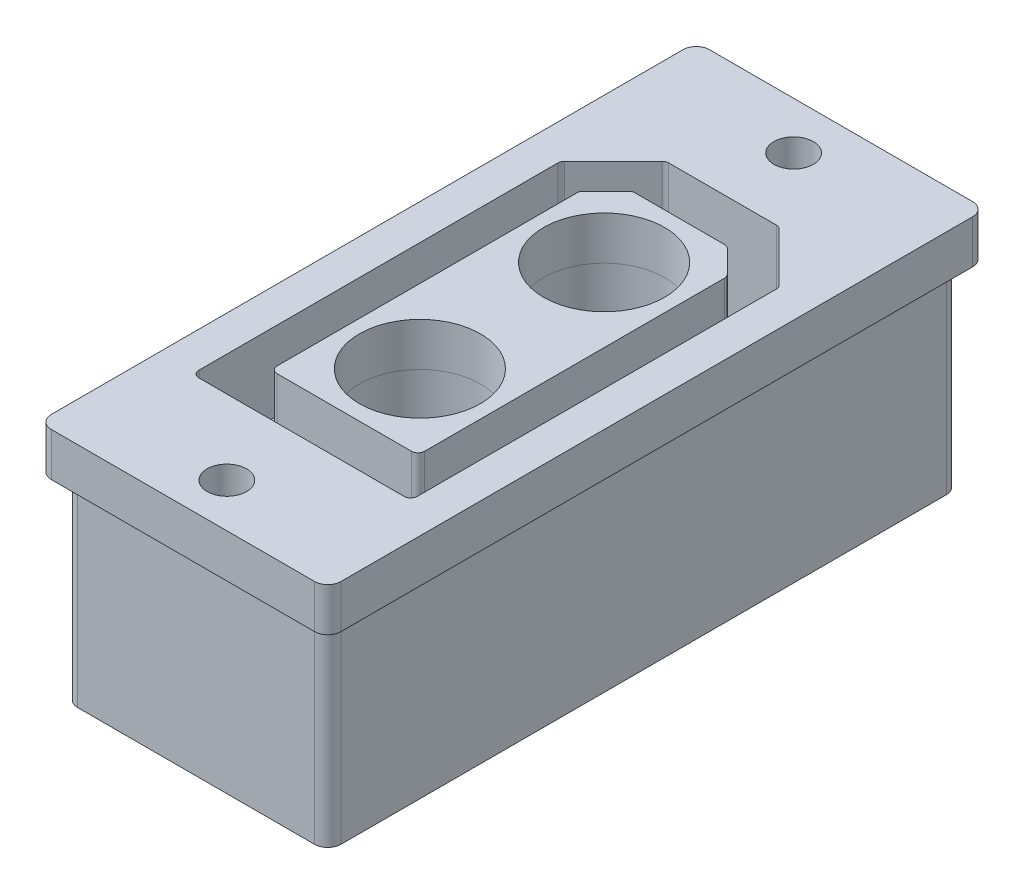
from build123d import *

# Parameters (mm, degrees)
SKETCH1_W             = 22
SKETCH1_H             = 50
SKETCH1_R             = 1.5
SKETCH1_W_2           = 16.6
SKETCH1_H_2           = 32
BOSS_EXTRUDE4_DEPTH   = 3.3
SKETCH1_W_3           = 11.22
SKETCH1_H_3           = 25.5
SKETCH1_R_2           = 4.6
BOSS_EXTRUDE4_2_DEPTH = 3.3
BOSS_EXTRUDE5_START   = -15
SKETCH1_7_W           = 20
SKETCH1_7_H           = 48
SKETCH1_7_R           = 1.5
SKETCH1_7_W_2         = 16.6
SKETCH1_7_H_2         = 32
SKETCH1_7_W_3         = 11.22
SKETCH1_7_H_3         = 25.5
SKETCH1_7_R_2         = 4.6
BOSS_EXTRUDE5_DEPTH   = 15
CHAMFER1_SIZE         = 2
CHAMFER2_SIZE         = 4
CHAMFER3_SIZE         = 2
FILLET1_R             = 0.5
FILLET2_R             = 0.5
FILLET3_R             = 1


with BuildPart() as part:
    # Sketch1 → Boss-Extrude4 (new body)
    with BuildSketch(Plane(origin=(0, 0, 0), x_dir=(1, 0, 0), z_dir=(0, 1, 0))):
        with Locations((11, 25)):
            Rectangle(SKETCH1_W, SKETCH1_H)
        with Locations(Location((11, 46.4, 0), (0, 0, 270))):
            Circle(SKETCH1_R, mode=Mode.SUBTRACT)
        with Locations(Location((11, 3.33141688, 0), (0, 0, 270))):
            Circle(SKETCH1_R, mode=Mode.SUBTRACT)
        with Locations((11, 25)):
            Rectangle(SKETCH1_W_2, SKETCH1_H_2, mode=Mode.SUBTRACT)
    extrude(amount=BOSS_EXTRUDE4_DEPTH)

    # Sketch1_7 → Boss-Extrude5 (add)
    # profile 1 of 2: a face of its own
    with BuildSketch(Plane(origin=(0, 0, 0), x_dir=(1, 0, 0), z_dir=(0, 1, 0)).offset(BOSS_EXTRUDE5_START)):
        with Locations((11, 25)):
            Rectangle(SKETCH1_7_W, SKETCH1_7_H)
        with Locations(Location((11, 46.4, 0), (0, 0, 270))):
            Circle(SKETCH1_7_R, mode=Mode.SUBTRACT)
        with Locations(Location((11, 3.33141688, 0), (0, 0, 270))):
            Circle(SKETCH1_7_R, mode=Mode.SUBTRACT)
        with Locations((11, 25)):
            Rectangle(SKETCH1_7_W_2, SKETCH1_7_H_2, mode=Mode.SUBTRACT)
    # profile 2 of 2: a face of its own
    with BuildSketch(Plane(origin=(0, 0, 0), x_dir=(1, 0, 0), z_dir=(0, 1, 0)).offset(BOSS_EXTRUDE5_START)):
        with Locations((11, 25)):
            Rectangle(SKETCH1_7_W_3, SKETCH1_7_H_3)
        with Locations(Location((11, 32, 0), (0, 0, 270))):
            Circle(SKETCH1_7_R_2, mode=Mode.SUBTRACT)
        with Locations(Location((11, 18, 0), (0, 0, 270))):
            Circle(SKETCH1_7_R_2, mode=Mode.SUBTRACT)
    extrude(amount=BOSS_EXTRUDE5_DEPTH)


with BuildPart() as body_2:
    # Sketch1 → Boss-Extrude4 2 (new body)
    with BuildSketch(Plane(origin=(0, 0, 0), x_dir=(1, 0, 0), z_dir=(0, 1, 0))):
        with Locations((11, 25)):
            Rectangle(SKETCH1_W_3, SKETCH1_H_3)
        with Locations(Location((11, 32, 0), (0, 0, 270))):
            Circle(SKETCH1_R_2, mode=Mode.SUBTRACT)
        with Locations(Location((11, 18, 0), (0, 0, 270))):
            Circle(SKETCH1_R_2, mode=Mode.SUBTRACT)
    extrude(amount=BOSS_EXTRUDE4_2_DEPTH)

    # Chamfer1
    chamfer1_edges = [body_2.edges().sort_by_distance(p)[0] for p in [
        (16.61, 1.65, -37.75),
        (5.39, 1.65, -37.75),
    ]]
    chamfer(chamfer1_edges, length=CHAMFER1_SIZE)

    # Fillet2
    fillet2_edges = [body_2.edges().sort_by_distance(p)[0] for p in [
        (16.61, 1.65, -12.25),
        (5.39, 1.65, -12.25),
        (7.39, 1.65, -37.75),
        (14.61, 1.65, -37.75),
        (16.61, 1.65, -35.75),
        (5.39, 1.65, -35.75),
    ]]
    fillet(fillet2_edges, radius=FILLET2_R)


with BuildPart() as boss_extrude5_piece_1:
    # of the separate pieces the step leaves, piece 1, a body of its own (boss_extrude5_pieces)
    add(part.part.solids().sort_by_distance((0, 0, 0))[0])

    # Chamfer2
    chamfer2_edges = [boss_extrude5_piece_1.edges().sort_by_distance(p)[0] for p in [
        (19.3, -5.85, -41),
        (2.7, -5.85, -41),
    ]]
    chamfer(chamfer2_edges, length=CHAMFER2_SIZE)

    # Fillet1
    fillet1_edges = [boss_extrude5_piece_1.edges().sort_by_distance(p)[0] for p in [
        (2.7, -5.85, -9),
        (19.3, -5.85, -9),
        (19.3, -5.85, -37),
        (6.7, -5.85, -41),
        (15.3, -5.85, -41),
        (2.7, -5.85, -37),
    ]]
    fillet(fillet1_edges, radius=FILLET1_R)

    # Fillet3
    fillet3_edges = [boss_extrude5_piece_1.edges().sort_by_distance(p)[0] for p in [
        (22, 1.65, 0),
        (0, 1.65, 0),
        (0, 1.65, -50),
        (22, 1.65, -50),
        (1, -7.5, -1),
        (1, -7.5, -49),
        (21, -7.5, -49),
        (21, -7.5, -1),
    ]]
    fillet(fillet3_edges, radius=FILLET3_R)


with BuildPart() as boss_extrude5_piece_2:
    # of the separate pieces the step leaves, piece 2, a body of its own (boss_extrude5_pieces)
    add(part.part.solids().sort_by_distance((16.61, -15, -37.75))[0])

    # Chamfer3
    chamfer3_edges = [boss_extrude5_piece_2.edges().sort_by_distance(p)[0] for p in [
        (16.61, -7.5, -37.75),
        (5.39, -7.5, -37.75),
    ]]
    chamfer(chamfer3_edges, length=CHAMFER3_SIZE)


solid = Compound([body_2.part, boss_extrude5_piece_1.part, boss_extrude5_piece_2.part])
